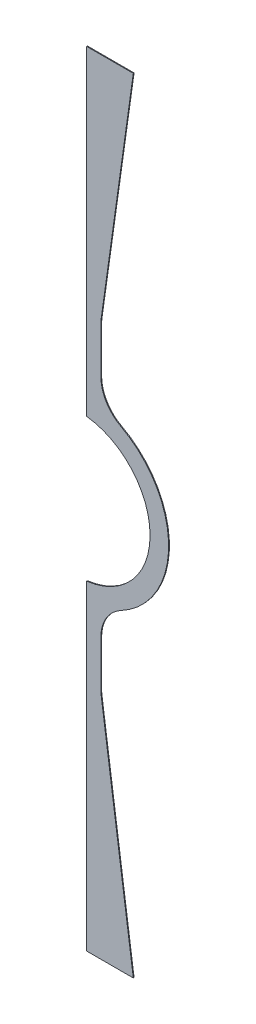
from build123d import *

# Parameters (mm, degrees)
EXTRUDE1_DEPTH = 0.205


with BuildPart() as part:
    # Sketch1 → Extrude1 (new, symmetric)
    with BuildSketch(Plane.XY):
        with BuildLine():
            Line((29.232493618, 208), (4.5, 208))
            Line((4.5, 208), (4.5, 37.873672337))
            ThreePointArc((4.5, 37.873672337), (38.14007153, 0), (4.5, -37.873672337))
            Line((4.5, -37.873672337), (4.5, -208))
            Line((4.5, -208), (29.232493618, -208))
            Line((29.232493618, -208), (12.194638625, -86.769362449))
            ThreePointArc((12.194638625, -86.769362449), (12.048718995, -85.381029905), (12, -83.98590043))
            Line((12, -83.98590043), (12, -60))
            ThreePointArc((12, -60), (14.850141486, -49.710084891), (22.588235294, -42.352941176))
            ThreePointArc((22.588235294, -42.352941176), (48, 0), (22.588235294, 42.352941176))
            ThreePointArc((22.588235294, 42.352941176), (14.850141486, 49.710084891), (12, 60))
            Line((12, 60), (12, 83.98590043))
            ThreePointArc((12, 83.98590043), (12.048718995, 85.381029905), (12.194638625, 86.769362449))
            Line((12.194638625, 86.769362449), (29.232493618, 208))
        make_face()
    extrude(amount=EXTRUDE1_DEPTH, both=True)


solid = part.part
